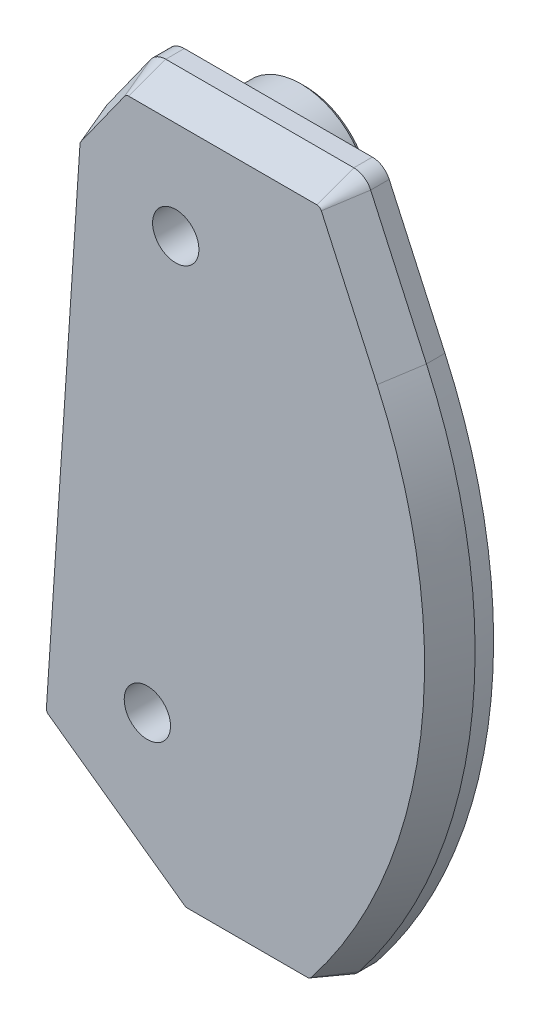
from build123d import *
from OCP.BRepFilletAPI import BRepFilletAPI_MakeChamfer

# Parameters (mm, degrees)
DODANIE_WYCI_GNI_CIE1_DEPTH = 6
ZAOKR_GLENIE1_R             = 2
DODANIE_WYCI_GNI_CIE2_DEPTH = 6
SZKIC6_R                    = 7
SZKIC6_R_2                  = 7.5
DODANIE_WYCI_GNI_CIE4_DEPTH = 8
WYTNIJ_WYCI_GNI_CIE1_DEPTH  = 102.042640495
ZAOKR_GLENIE2_R             = 2
OTW_R_5_0_5_1_D             = 5
SFAZOWANIE1_SIZE            = 0.5
SFAZOWANIE2_SIZE            = 4
SFAZOWANIE2_SIZE2           = 1.455880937


with BuildPart() as part:
    # Szkic2 → Dodanie-wyci_gni_cie1 (new body)
    with BuildSketch(Plane.XY):
        with BuildLine():
            Line((-16.543143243, 50.112063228), (-33.531754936, 50.112063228))
            Line((-33.531754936, 50.112063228), (-33.531754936, -23.887936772))
            Line((-33.531754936, -23.887936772), (-16.543143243, -23.887936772))
            ThreePointArc((-16.543143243, -23.887936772), (-3.379639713, 13.112063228), (-16.543143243, 50.112063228))
        make_face()
    extrude(amount=DODANIE_WYCI_GNI_CIE1_DEPTH)

    # Zaokr_glenie1
    zaokr_glenie1_edges = [part.edges().sort_by_distance(p)[0] for p in [
        (-16.543143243, -23.887936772, 3),
        (-33.531754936, -23.887936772, 3),
        (-33.531754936, 50.112063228, 3),
        (-16.543143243, 50.112063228, 3),
    ]]
    fillet(zaokr_glenie1_edges, radius=ZAOKR_GLENIE1_R)

    # Szkic4 → Dodanie-wyci_gni_cie2 (add)
    with BuildSketch(Plane.XY.offset(6)):
        with BuildLine():
            Line((-71.327037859, 4.871603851), (-33.514312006, -22.151503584))
            ThreePointArc((-33.514312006, -22.151503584), (-33.527389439, -22.020008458), (-33.531754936, -21.887936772))
            Line((-33.531754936, -21.887936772), (-33.531754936, 48.112063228))
            ThreePointArc((-33.531754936, 48.112063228), (-32.945968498, 49.52627679), (-31.531754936, 50.112063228))
            Line((-31.531754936, 50.112063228), (-17.503651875, 50.112063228))
            ThreePointArc((-17.503651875, 50.112063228), (-16.63023995, 49.911271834), (-15.932201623, 49.349214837))
            ThreePointArc((-15.932201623, 49.349214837), (-11.921738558, 43.572725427), (-8.632335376, 37.357303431))
            Line((-8.632335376, 37.357303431), (-23.982123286, 71.120101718))
            Line((-23.982123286, 71.120101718), (-71.327037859, 4.871603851))
        make_face()
    extrude(amount=-DODANIE_WYCI_GNI_CIE2_DEPTH)

    # Szkic6 → Dodanie-wyci_gni_cie4 (add)
    with BuildSketch(Plane(origin=(0, 0, 0), x_dir=(-1, 0, 0), z_dir=(0, 0, -1))):
        with Locations(Location((34.763315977, -6.325097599, 0), (0, 0, 180))):
            Circle(SZKIC6_R)
        with Locations(Location((31.699002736, 39.769655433, 0), (0, 0, 180))):
            Circle(SZKIC6_R_2)
    extrude(amount=DODANIE_WYCI_GNI_CIE4_DEPTH)

    # Szkic7 → Wytnij-wyci_gni_cie1 (cut, through all)
    with BuildSketch(Plane(origin=(0, 0, 0), x_dir=(-1, 0, 0), z_dir=(0, 0, -1))):
        Polygon((15.18685616, 51.774373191), (37.807672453, 51.774373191), (43.452527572, 43.875675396), (47.192097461, -12.376586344), (9.960681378, -38.984257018), (95.348856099, -24.379245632), (96.104638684, 89.177087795), (10.890152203, 88.232359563), align=None)
    extrude(amount=-WYTNIJ_WYCI_GNI_CIE1_DEPTH, mode=Mode.SUBTRACT)

    # Zaokr_glenie2
    zaokr_glenie2_edges = [part.edges().sort_by_distance(p)[0] for p in [
        (-31.084566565, -23.887936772, 3),
        (-15.18685616, 51.774373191, 3),
        (-47.192097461, -12.376586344, 3),
        (-43.452527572, 43.875675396, 3),
        (-37.807672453, 51.774373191, 3),
    ]]
    fillet(zaokr_glenie2_edges, radius=ZAOKR_GLENIE2_R)

    # Otw_r _5.0 _5_1 (through all)
    with Locations(Plane(origin=(0, 0, -8), x_dir=(-1, 0, 0), z_dir=(0, 0, -1))):
        with Locations((31.699002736, 39.769655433), (34.763315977, -6.325097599)):
            Hole(OTW_R_5_0_5_1_D / 2)

    # Sfazowanie1
    sfazowanie1_edges = [part.edges().sort_by_distance(p)[0] for p in [
        (-41.763315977, -6.325097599, -8),
        (-39.199002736, 39.769655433, -8),
    ]]
    chamfer(sfazowanie1_edges, length=SFAZOWANIE1_SIZE)

    # Sfazowanie2: one chamfer whose edges measure the first distance from different faces: ONE call of the kernel's chamfer builder (chamfer() names one face for all edges)
    sfazowanie2_edges_1 = [part.edges().sort_by_distance(p)[0] for p in [
        (-26.626661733, 51.774373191, 6),
    ]]
    sfazowanie2_side_1 = [part.faces().sort_by_distance(p)[0] for p in [
        (-26.626661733, 51.774373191, 3),
    ]]
    sfazowanie2_edges_2 = [part.edges().sort_by_distance(p)[0] for p in [
        (-38.945850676, -18.269819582, 6),
    ]]
    sfazowanie2_side_2 = [part.faces().sort_by_distance(p)[0] for p in [
        (-38.945850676, -18.269819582, 3),
    ]]
    sfazowanie2_edges_3 = [part.edges().sort_by_distance(p)[0] for p in [
        (-23.973508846, -23.887936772, 6),
    ]]
    sfazowanie2_side_3 = [part.faces().sort_by_distance(p)[0] for p in [
        (-23.973508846, -23.887936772, 3),
    ]]
    sfazowanie2_edges_4 = [part.edges().sort_by_distance(p)[0] for p in [
        (-40.763884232, 47.637823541, 6),
    ]]
    sfazowanie2_side_4 = [part.faces().sort_by_distance(p)[0] for p in [
        (-40.763884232, 47.637823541, 3),
    ]]
    sfazowanie2_edges_5 = [part.edges().sort_by_distance(p)[0] for p in [
        (-45.304216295, 16.021755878, 6),
    ]]
    sfazowanie2_side_5 = [part.faces().sort_by_distance(p)[0] for p in [
        (-45.304216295, 16.021755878, 3),
    ]]
    sfazowanie2_edges_6 = [part.edges().sort_by_distance(p)[0] for p in [
        (-31.053954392, -23.792452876, 6),
    ]]
    sfazowanie2_side_6 = [part.faces().sort_by_distance(p)[0] for p in [
        (-31.053954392, -23.792452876, 3),
    ]]
    sfazowanie2_edges_7 = [part.edges().sort_by_distance(p)[0] for p in [
        (-46.930413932, -12.252763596, 6),
    ]]
    sfazowanie2_side_7 = [part.faces().sort_by_distance(p)[0] for p in [
        (-46.930413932, -12.252763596, 3),
    ]]
    sfazowanie2_edges_8 = [part.edges().sort_by_distance(p)[0] for p in [
        (-43.377863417, 43.84897477, 6),
    ]]
    sfazowanie2_side_8 = [part.faces().sort_by_distance(p)[0] for p in [
        (-43.377863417, 43.84897477, 3),
    ]]
    sfazowanie2_edges_9 = [part.edges().sort_by_distance(p)[0] for p in [
        (-37.693691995, 51.552820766, 6),
    ]]
    sfazowanie2_side_9 = [part.faces().sort_by_distance(p)[0] for p in [
        (-37.693691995, 51.552820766, 3),
    ]]
    sfazowanie2_edges_10 = [part.edges().sort_by_distance(p)[0] for p in [
        (-15.391868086, 51.45596253, 6),
    ]]
    sfazowanie2_side_10 = [part.faces().sort_by_distance(p)[0] for p in [
        (-15.391868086, 51.45596253, 3),
    ]]
    sfazowanie2_edges_11 = [part.edges().sort_by_distance(p)[0] for p in [
        (-3.801714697, 6.092554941, 6),
    ]]
    sfazowanie2_side_11 = [part.faces().sort_by_distance(p)[0] for p in [
        (-3.801714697, 6.092554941, 3),
    ]]
    sfazowanie2_edges_12 = [part.edges().sort_by_distance(p)[0] for p in [
        (-16.63023995, -23.687145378, 6),
    ]]
    sfazowanie2_side_12 = [part.faces().sort_by_distance(p)[0] for p in [
        (-16.63023995, -23.687145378, 3),
    ]]
    sfazowanie2_edges_13 = [part.edges().sort_by_distance(p)[0] for p in [
        (-11.643120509, 43.979709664, 6),
    ]]
    sfazowanie2_side_13 = [part.faces().sort_by_distance(p)[0] for p in [
        (-11.643120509, 43.979709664, 3),
    ]]
    sfazowanie2 = BRepFilletAPI_MakeChamfer(part.part.solid().wrapped)
    for e in sfazowanie2_edges_1:
        sfazowanie2.Add(SFAZOWANIE2_SIZE, SFAZOWANIE2_SIZE2, e.wrapped, sfazowanie2_side_1[0].wrapped)  # the first distance lies on this face
    for e in sfazowanie2_edges_2:
        sfazowanie2.Add(SFAZOWANIE2_SIZE, SFAZOWANIE2_SIZE2, e.wrapped, sfazowanie2_side_2[0].wrapped)  # the first distance lies on this face
    for e in sfazowanie2_edges_3:
        sfazowanie2.Add(SFAZOWANIE2_SIZE, SFAZOWANIE2_SIZE2, e.wrapped, sfazowanie2_side_3[0].wrapped)  # the first distance lies on this face
    for e in sfazowanie2_edges_4:
        sfazowanie2.Add(SFAZOWANIE2_SIZE, SFAZOWANIE2_SIZE2, e.wrapped, sfazowanie2_side_4[0].wrapped)  # the first distance lies on this face
    for e in sfazowanie2_edges_5:
        sfazowanie2.Add(SFAZOWANIE2_SIZE, SFAZOWANIE2_SIZE2, e.wrapped, sfazowanie2_side_5[0].wrapped)  # the first distance lies on this face
    for e in sfazowanie2_edges_6:
        sfazowanie2.Add(SFAZOWANIE2_SIZE, SFAZOWANIE2_SIZE2, e.wrapped, sfazowanie2_side_6[0].wrapped)  # the first distance lies on this face
    for e in sfazowanie2_edges_7:
        sfazowanie2.Add(SFAZOWANIE2_SIZE, SFAZOWANIE2_SIZE2, e.wrapped, sfazowanie2_side_7[0].wrapped)  # the first distance lies on this face
    for e in sfazowanie2_edges_8:
        sfazowanie2.Add(SFAZOWANIE2_SIZE, SFAZOWANIE2_SIZE2, e.wrapped, sfazowanie2_side_8[0].wrapped)  # the first distance lies on this face
    for e in sfazowanie2_edges_9:
        sfazowanie2.Add(SFAZOWANIE2_SIZE, SFAZOWANIE2_SIZE2, e.wrapped, sfazowanie2_side_9[0].wrapped)  # the first distance lies on this face
    for e in sfazowanie2_edges_10:
        sfazowanie2.Add(SFAZOWANIE2_SIZE, SFAZOWANIE2_SIZE2, e.wrapped, sfazowanie2_side_10[0].wrapped)  # the first distance lies on this face
    for e in sfazowanie2_edges_11:
        sfazowanie2.Add(SFAZOWANIE2_SIZE, SFAZOWANIE2_SIZE2, e.wrapped, sfazowanie2_side_11[0].wrapped)  # the first distance lies on this face
    for e in sfazowanie2_edges_12:
        sfazowanie2.Add(SFAZOWANIE2_SIZE, SFAZOWANIE2_SIZE2, e.wrapped, sfazowanie2_side_12[0].wrapped)  # the first distance lies on this face
    for e in sfazowanie2_edges_13:
        sfazowanie2.Add(SFAZOWANIE2_SIZE, SFAZOWANIE2_SIZE2, e.wrapped, sfazowanie2_side_13[0].wrapped)  # the first distance lies on this face
    add(Compound.cast(sfazowanie2.Shape()), mode=Mode.REPLACE)


solid = part.part
